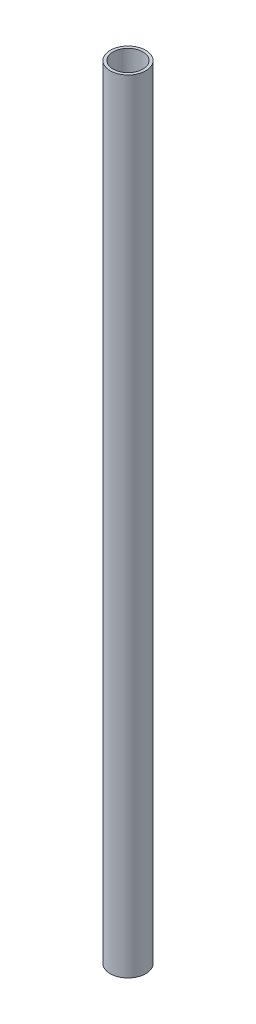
ISO-10303-21;
HEADER;
FILE_DESCRIPTION(('STEP AP214'),'2;1');
FILE_NAME('part.step','',(''),(''),'','','');
FILE_SCHEMA(('AUTOMOTIVE_DESIGN { 1 0 10303 214 1 1 1 1 }'));
ENDSEC;
DATA;
#1=APPLICATION_CONTEXT('core data for automotive mechanical design processes');
#2=APPLICATION_PROTOCOL_DEFINITION('international standard','automotive_design',2000,#1);
#3=PRODUCT_CONTEXT('',#1,'mechanical');
#4=PRODUCT('Part','Part','',(#3));
#5=PRODUCT_RELATED_PRODUCT_CATEGORY('part','',(#4));
#6=PRODUCT_DEFINITION_FORMATION('','',#4);
#7=PRODUCT_DEFINITION_CONTEXT('part definition',#1,'design');
#8=PRODUCT_DEFINITION('design','',#6,#7);
#9=PRODUCT_DEFINITION_SHAPE('','',#8);
#10=(LENGTH_UNIT() NAMED_UNIT(*) SI_UNIT(.MILLI.,.METRE.));
#11=(NAMED_UNIT(*) PLANE_ANGLE_UNIT() SI_UNIT($,.RADIAN.));
#12=(NAMED_UNIT(*) SI_UNIT($,.STERADIAN.) SOLID_ANGLE_UNIT());
#13=UNCERTAINTY_MEASURE_WITH_UNIT(LENGTH_MEASURE(1.E-05),#10,'distance_accuracy_value','');
#14=(GEOMETRIC_REPRESENTATION_CONTEXT(3) GLOBAL_UNCERTAINTY_ASSIGNED_CONTEXT((#13)) GLOBAL_UNIT_ASSIGNED_CONTEXT((#10,
#11,#12)) REPRESENTATION_CONTEXT('',''));
#15=CARTESIAN_POINT('',(0.,0.,0.));
#16=DIRECTION('',(0.,0.,1.));
#17=DIRECTION('',(1.,0.,0.));
#18=AXIS2_PLACEMENT_3D('',#15,#16,#17);
#19=CARTESIAN_POINT('',(0.,550.,0.));
#20=DIRECTION('',(0.,1.,0.));
#21=DIRECTION('',(0.,0.,1.));
#22=AXIS2_PLACEMENT_3D('',#19,#20,#21);
#23=PLANE('',#22);
#24=CARTESIAN_POINT('',(0.,550.,0.));
#25=DIRECTION('',(0.,1.,0.));
#26=DIRECTION('',(0.,0.,1.));
#27=AXIS2_PLACEMENT_3D('',#24,#25,#26);
#28=CIRCLE('',#27,12.5);
#29=CARTESIAN_POINT('',(0.,550.,12.5));
#30=VERTEX_POINT('',#29);
#31=EDGE_CURVE('E10',#30,#30,#28,.T.);
#32=ORIENTED_EDGE('',*,*,#31,.T.);
#33=EDGE_LOOP('',(#32));
#34=FACE_BOUND('',#33,.T.);
#35=CARTESIAN_POINT('',(0.,550.,0.));
#36=DIRECTION('',(0.,1.,0.));
#37=DIRECTION('',(0.,0.,1.));
#38=AXIS2_PLACEMENT_3D('',#35,#36,#37);
#39=CIRCLE('',#38,10.5);
#40=CARTESIAN_POINT('',(0.,550.,10.5));
#41=VERTEX_POINT('',#40);
#42=EDGE_CURVE('E56',#41,#41,#39,.T.);
#43=ORIENTED_EDGE('',*,*,#42,.F.);
#44=EDGE_LOOP('',(#43));
#45=FACE_BOUND('',#44,.T.);
#46=ADVANCED_FACE('F43',(#34,#45),#23,.T.);
#47=CARTESIAN_POINT('',(0.,0.,0.));
#48=DIRECTION('',(0.,1.,0.));
#49=DIRECTION('',(0.,0.,1.));
#50=AXIS2_PLACEMENT_3D('',#47,#48,#49);
#51=PLANE('',#50);
#52=CARTESIAN_POINT('',(0.,0.,0.));
#53=DIRECTION('',(0.,1.,0.));
#54=DIRECTION('',(0.,0.,1.));
#55=AXIS2_PLACEMENT_3D('',#52,#53,#54);
#56=CIRCLE('',#55,12.5);
#57=CARTESIAN_POINT('',(0.,0.,12.5));
#58=VERTEX_POINT('',#57);
#59=EDGE_CURVE('E47',#58,#58,#56,.T.);
#60=ORIENTED_EDGE('',*,*,#59,.F.);
#61=EDGE_LOOP('',(#60));
#62=FACE_BOUND('',#61,.T.);
#63=CARTESIAN_POINT('',(0.,0.,0.));
#64=DIRECTION('',(0.,1.,0.));
#65=DIRECTION('',(0.,0.,1.));
#66=AXIS2_PLACEMENT_3D('',#63,#64,#65);
#67=CIRCLE('',#66,10.5);
#68=CARTESIAN_POINT('',(0.,0.,10.5));
#69=VERTEX_POINT('',#68);
#70=EDGE_CURVE('E58',#69,#69,#67,.T.);
#71=ORIENTED_EDGE('',*,*,#70,.T.);
#72=EDGE_LOOP('',(#71));
#73=FACE_BOUND('',#72,.T.);
#74=ADVANCED_FACE('F70',(#62,#73),#51,.F.);
#75=CARTESIAN_POINT('',(0.,550.,0.));
#76=DIRECTION('',(0.,-1.,0.));
#77=DIRECTION('',(0.,0.,-1.));
#78=AXIS2_PLACEMENT_3D('',#75,#76,#77);
#79=CYLINDRICAL_SURFACE('',#78,12.5);
#80=ORIENTED_EDGE('',*,*,#31,.F.);
#81=EDGE_LOOP('',(#80));
#82=FACE_BOUND('',#81,.T.);
#83=ORIENTED_EDGE('',*,*,#59,.T.);
#84=EDGE_LOOP('',(#83));
#85=FACE_BOUND('',#84,.T.);
#86=ADVANCED_FACE('F45',(#82,#85),#79,.T.);
#87=CARTESIAN_POINT('',(0.,550.,0.));
#88=DIRECTION('',(0.,-1.,0.));
#89=DIRECTION('',(0.,0.,-1.));
#90=AXIS2_PLACEMENT_3D('',#87,#88,#89);
#91=CYLINDRICAL_SURFACE('',#90,10.5);
#92=ORIENTED_EDGE('',*,*,#42,.T.);
#93=EDGE_LOOP('',(#92));
#94=FACE_BOUND('',#93,.T.);
#95=ORIENTED_EDGE('',*,*,#70,.F.);
#96=EDGE_LOOP('',(#95));
#97=FACE_BOUND('',#96,.T.);
#98=ADVANCED_FACE('F66',(#94,#97),#91,.F.);
#99=CLOSED_SHELL('',(#46,#74,#86,#98));
#100=MANIFOLD_SOLID_BREP('B2',#99);
#101=ADVANCED_BREP_SHAPE_REPRESENTATION('',(#18,#100),#14);
#102=SHAPE_DEFINITION_REPRESENTATION(#9,#101);
ENDSEC;
END-ISO-10303-21;
